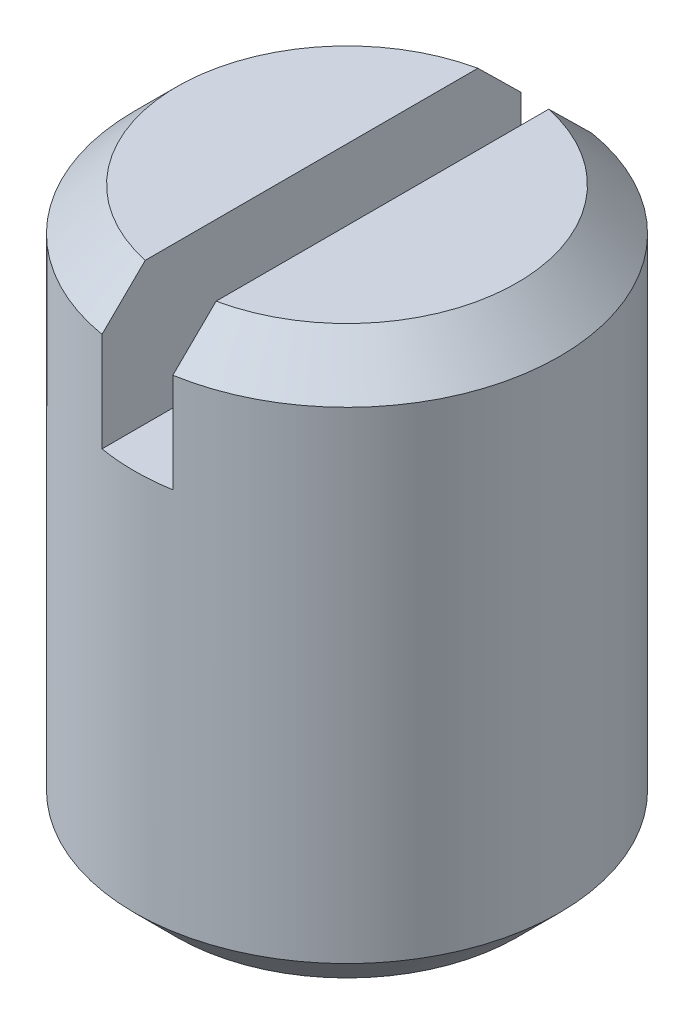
ISO-10303-21;
HEADER;
FILE_DESCRIPTION(('STEP AP214'),'2;1');
FILE_NAME('part.step','',(''),(''),'','','');
FILE_SCHEMA(('AUTOMOTIVE_DESIGN { 1 0 10303 214 1 1 1 1 }'));
ENDSEC;
DATA;
#1=APPLICATION_CONTEXT('core data for automotive mechanical design processes');
#2=APPLICATION_PROTOCOL_DEFINITION('international standard','automotive_design',2000,#1);
#3=PRODUCT_CONTEXT('',#1,'mechanical');
#4=PRODUCT('Part','Part','',(#3));
#5=PRODUCT_RELATED_PRODUCT_CATEGORY('part','',(#4));
#6=PRODUCT_DEFINITION_FORMATION('','',#4);
#7=PRODUCT_DEFINITION_CONTEXT('part definition',#1,'design');
#8=PRODUCT_DEFINITION('design','',#6,#7);
#9=PRODUCT_DEFINITION_SHAPE('','',#8);
#10=(LENGTH_UNIT() NAMED_UNIT(*) SI_UNIT(.MILLI.,.METRE.));
#11=(NAMED_UNIT(*) PLANE_ANGLE_UNIT() SI_UNIT($,.RADIAN.));
#12=(NAMED_UNIT(*) SI_UNIT($,.STERADIAN.) SOLID_ANGLE_UNIT());
#13=UNCERTAINTY_MEASURE_WITH_UNIT(LENGTH_MEASURE(1.E-05),#10,'distance_accuracy_value','');
#14=(GEOMETRIC_REPRESENTATION_CONTEXT(3) GLOBAL_UNCERTAINTY_ASSIGNED_CONTEXT((#13)) GLOBAL_UNIT_ASSIGNED_CONTEXT((#10,
#11,#12)) REPRESENTATION_CONTEXT('',''));
#15=CARTESIAN_POINT('',(0.,0.,0.));
#16=DIRECTION('',(0.,0.,1.));
#17=DIRECTION('',(1.,0.,0.));
#18=AXIS2_PLACEMENT_3D('',#15,#16,#17);
#19=CARTESIAN_POINT('',(0.,0.,0.));
#20=DIRECTION('',(0.,-1.,0.));
#21=DIRECTION('',(0.,0.,-1.));
#22=AXIS2_PLACEMENT_3D('',#19,#20,#21);
#23=PLANE('',#22);
#24=CARTESIAN_POINT('',(0.,0.,0.));
#25=DIRECTION('',(0.,-1.,0.));
#26=DIRECTION('',(0.,0.,-1.));
#27=AXIS2_PLACEMENT_3D('',#24,#25,#26);
#28=CIRCLE('',#27,2.4);
#29=CARTESIAN_POINT('',(0.500000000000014,0.,2.3473389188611));
#30=VERTEX_POINT('',#29);
#31=CARTESIAN_POINT('',(0.500000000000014,0.,-2.3473389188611));
#32=VERTEX_POINT('',#31);
#33=EDGE_CURVE('E94',#30,#32,#28,.F.);
#34=ORIENTED_EDGE('',*,*,#33,.T.);
#35=DIRECTION('',(0.,0.,-1.));
#36=VECTOR('',#35,1.);
#37=CARTESIAN_POINT('',(0.500000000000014,0.,3.));
#38=LINE('',#37,#36);
#39=EDGE_CURVE('E83',#30,#32,#38,.T.);
#40=ORIENTED_EDGE('',*,*,#39,.F.);
#41=EDGE_LOOP('',(#34,#40));
#42=FACE_BOUND('',#41,.T.);
#43=ADVANCED_FACE('F28',(#42),#23,.F.);
#44=CARTESIAN_POINT('',(0.,0.,0.));
#45=DIRECTION('',(0.,-1.,0.));
#46=DIRECTION('',(0.,0.,-1.));
#47=AXIS2_PLACEMENT_3D('',#44,#45,#46);
#48=CONICAL_SURFACE('',#47,2.4,0.785398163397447);
#49=CARTESIAN_POINT('',(0.500000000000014,1.81909847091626,-0.295713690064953));
#50=CARTESIAN_POINT('',(0.500000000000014,1.80683306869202,-0.319750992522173));
#51=CARTESIAN_POINT('',(0.500000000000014,1.79374756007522,-0.343341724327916));
#52=CARTESIAN_POINT('',(0.500000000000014,1.76632309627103,-0.389750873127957));
#53=CARTESIAN_POINT('',(0.500000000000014,1.7519855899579,-0.412570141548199));
#54=CARTESIAN_POINT('',(0.500000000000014,1.72245766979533,-0.457545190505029));
#55=CARTESIAN_POINT('',(0.500000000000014,1.70726988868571,-0.479702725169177));
#56=CARTESIAN_POINT('',(0.500000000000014,1.67621678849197,-0.523546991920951));
#57=CARTESIAN_POINT('',(0.500000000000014,1.66035124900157,-0.545233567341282));
#58=CARTESIAN_POINT('',(0.500000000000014,1.61210780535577,-0.609576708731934));
#59=CARTESIAN_POINT('',(0.500000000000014,1.57897970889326,-0.651668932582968));
#60=CARTESIAN_POINT('',(0.500000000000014,1.51147311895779,-0.734892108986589));
#61=CARTESIAN_POINT('',(0.500000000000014,1.47709345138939,-0.776022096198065));
#62=CARTESIAN_POINT('',(0.500000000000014,1.40844074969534,-0.856515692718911));
#63=CARTESIAN_POINT('',(0.500000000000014,1.37418875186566,-0.895897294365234));
#64=CARTESIAN_POINT('',(0.500000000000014,1.30514716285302,-0.974187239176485));
#65=CARTESIAN_POINT('',(0.500000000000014,1.27035755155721,-1.01309556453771));
#66=CARTESIAN_POINT('',(0.500000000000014,1.1654069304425,-1.12930934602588));
#67=CARTESIAN_POINT('',(0.500000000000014,1.0946714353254,-1.20609519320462));
#68=CARTESIAN_POINT('',(0.500000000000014,0.952342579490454,-1.35884765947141));
#69=CARTESIAN_POINT('',(0.500000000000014,0.880749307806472,-1.43481436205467));
#70=CARTESIAN_POINT('',(0.500000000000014,0.737014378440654,-1.58621658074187));
#71=CARTESIAN_POINT('',(0.500000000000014,0.664872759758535,-1.66165213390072));
#72=CARTESIAN_POINT('',(0.500000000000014,0.447151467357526,-1.88822590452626));
#73=CARTESIAN_POINT('',(0.500000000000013,0.30102405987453,-2.03883696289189));
#74=CARTESIAN_POINT('',(0.500000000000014,0.00805243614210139,-2.33933547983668));
#75=CARTESIAN_POINT('',(0.500000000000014,-0.138791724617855,-2.48922299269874));
#76=CARTESIAN_POINT('',(0.500000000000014,-0.470302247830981,-2.82663559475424));
#77=CARTESIAN_POINT('',(0.500000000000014,-0.655091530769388,-3.01403988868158));
#78=CARTESIAN_POINT('',(0.500000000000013,-1.02505279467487,-3.3884807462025));
#79=CARTESIAN_POINT('',(0.500000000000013,-1.21022478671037,-3.57551729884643));
#80=CARTESIAN_POINT('',(0.500000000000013,-1.57944526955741,-3.94798531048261));
#81=CARTESIAN_POINT('',(0.500000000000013,-1.76349203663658,-4.13341847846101));
#82=CARTESIAN_POINT('',(0.500000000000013,-2.13173997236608,-4.50411934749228));
#83=CARTESIAN_POINT('',(0.500000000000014,-2.31594113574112,-4.68938705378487));
#84=CARTESIAN_POINT('',(0.500000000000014,-2.50018656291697,-4.8746105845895));
#85=B_SPLINE_CURVE_WITH_KNOTS('',3,(#49,#50,#51,#52,#53,#54,#55,#56,#57,#58,#59,#60,#61,#62,#63,
#64,#65,#66,#67,#68,#69,#70,#71,#72,#73,#74,#75,#76,#77,#78,#79,#80,#81,#82,#83,#84),
.UNSPECIFIED.,.F.,.F.,(4,2,2,2,2,2,2,2,2,2,2,2,2,2,2,2,2,4),(0.,0.0809053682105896,
0.161718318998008,0.24229357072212,0.322895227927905,0.483547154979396,0.644353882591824,
0.800925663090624,0.95750331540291,1.27069203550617,1.58384852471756,1.8969829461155,
2.52652617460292,3.15602141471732,3.94558150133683,4.73516475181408,5.51895544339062,
6.30272036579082),.UNSPECIFIED.);
#86=CARTESIAN_POINT('',(0.500000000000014,-0.600000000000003,-2.95803989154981));
#87=VERTEX_POINT('',#86);
#88=EDGE_CURVE('E51',#32,#87,#85,.T.);
#89=ORIENTED_EDGE('',*,*,#88,.F.);
#90=ORIENTED_EDGE('',*,*,#33,.F.);
#91=CARTESIAN_POINT('',(0.500000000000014,-2.50018656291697,4.8746105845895));
#92=CARTESIAN_POINT('',(0.500000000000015,-2.31518080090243,4.68862360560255));
#93=CARTESIAN_POINT('',(0.500000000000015,-2.13022040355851,4.50259141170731));
#94=CARTESIAN_POINT('',(0.500000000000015,-1.76050201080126,4.13040668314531));
#95=CARTESIAN_POINT('',(0.500000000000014,-1.57574398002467,3.94425418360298));
#96=CARTESIAN_POINT('',(0.500000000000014,-1.20657166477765,3.57182927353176));
#97=CARTESIAN_POINT('',(0.500000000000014,-1.02215724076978,3.38555700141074));
#98=CARTESIAN_POINT('',(0.500000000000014,-0.745803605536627,3.10584681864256));
#99=CARTESIAN_POINT('',(0.500000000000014,-0.653721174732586,3.01255042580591));
#100=CARTESIAN_POINT('',(0.500000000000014,-0.469680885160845,2.82583051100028));
#101=CARTESIAN_POINT('',(0.500000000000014,-0.377723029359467,2.73240698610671));
#102=CARTESIAN_POINT('',(0.500000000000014,-0.193863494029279,2.54527638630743));
#103=CARTESIAN_POINT('',(0.500000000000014,-0.101962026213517,2.45156910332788));
#104=CARTESIAN_POINT('',(0.500000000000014,0.0815957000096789,2.26392997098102));
#105=CARTESIAN_POINT('',(0.500000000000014,0.173251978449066,2.16999814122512));
#106=CARTESIAN_POINT('',(0.500000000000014,0.356159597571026,1.98185993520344));
#107=CARTESIAN_POINT('',(0.500000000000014,0.44741116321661,1.88765377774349));
#108=CARTESIAN_POINT('',(0.500000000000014,0.629419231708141,1.69870815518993));
#109=CARTESIAN_POINT('',(0.500000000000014,0.720175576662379,1.60396853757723));
#110=CARTESIAN_POINT('',(0.500000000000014,0.855759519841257,1.46112952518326));
#111=CARTESIAN_POINT('',(0.500000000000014,0.900913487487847,1.41334010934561));
#112=CARTESIAN_POINT('',(0.500000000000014,0.990922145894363,1.31748760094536));
#113=CARTESIAN_POINT('',(0.500000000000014,1.03577686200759,1.26942453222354));
#114=CARTESIAN_POINT('',(0.500000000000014,1.12503774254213,1.17297174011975));
#115=CARTESIAN_POINT('',(0.500000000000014,1.1694443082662,1.12458238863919));
#116=CARTESIAN_POINT('',(0.500000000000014,1.2576979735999,1.02726652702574));
#117=CARTESIAN_POINT('',(0.500000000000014,1.30154489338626,0.978339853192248));
#118=CARTESIAN_POINT('',(0.500000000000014,1.38853350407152,0.879553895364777));
#119=CARTESIAN_POINT('',(0.500000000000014,1.43167214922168,0.829691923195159));
#120=CARTESIAN_POINT('',(0.500000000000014,1.51655495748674,0.728853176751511));
#121=CARTESIAN_POINT('',(0.500000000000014,1.55830030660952,0.677877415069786));
#122=CARTESIAN_POINT('',(0.500000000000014,1.61921521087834,0.599904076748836));
#123=CARTESIAN_POINT('',(0.500000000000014,1.63927572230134,0.573605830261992));
#124=CARTESIAN_POINT('',(0.500000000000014,1.67854779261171,0.520399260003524));
#125=CARTESIAN_POINT('',(0.500000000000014,1.69775972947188,0.493491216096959));
#126=CARTESIAN_POINT('',(0.500000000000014,1.73507848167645,0.438780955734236));
#127=CARTESIAN_POINT('',(0.500000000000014,1.75318168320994,0.4109762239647));
#128=CARTESIAN_POINT('',(0.500000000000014,1.78762712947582,0.354244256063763));
#129=CARTESIAN_POINT('',(0.500000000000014,1.80396653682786,0.325315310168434));
#130=CARTESIAN_POINT('',(0.500000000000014,1.81909847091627,0.295713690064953));
#131=B_SPLINE_CURVE_WITH_KNOTS('',3,(#91,#92,#93,#94,#95,#96,#97,#98,#99,#100,#101,#102,#103,
#104,#105,#106,#107,#108,#109,#110,#111,#112,#113,#114,#115,#116,#117,#118,#119,#120,#121,#122,
#123,#124,#125,#126,#127,#128,#129,#130),.UNSPECIFIED.,.F.,.F.,(4,2,2,2,2,2,2,2,2,2,2,2,2,2,2,2,
2,2,2,4),(0.,0.7869972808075,1.57382280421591,2.36017750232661,2.75343371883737,
3.14669914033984,3.54045312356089,3.93417388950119,4.3276380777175,4.72122113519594,
4.91846220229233,5.11568634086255,5.31271457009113,5.50980458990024,5.70759226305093,
5.90520704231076,6.00442239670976,6.10359310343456,6.20307150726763,6.30270762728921),.UNSPECIFIED.);
#132=CARTESIAN_POINT('',(0.500000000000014,-0.600000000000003,2.95803989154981));
#133=VERTEX_POINT('',#132);
#134=EDGE_CURVE('E79',#133,#30,#131,.T.);
#135=ORIENTED_EDGE('',*,*,#134,.F.);
#136=CARTESIAN_POINT('',(0.,-0.600000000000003,0.));
#137=DIRECTION('',(0.,-1.,0.));
#138=DIRECTION('',(0.,0.,-1.));
#139=AXIS2_PLACEMENT_3D('',#136,#137,#138);
#140=CIRCLE('',#139,3.);
#141=EDGE_CURVE('E109',#87,#133,#140,.T.);
#142=ORIENTED_EDGE('',*,*,#141,.F.);
#143=EDGE_LOOP('',(#89,#90,#135,#142));
#144=FACE_BOUND('',#143,.T.);
#145=ADVANCED_FACE('F96',(#144),#48,.T.);
#146=CARTESIAN_POINT('',(0.,-8.,0.));
#147=DIRECTION('',(0.,1.,0.));
#148=DIRECTION('',(0.,0.,1.));
#149=AXIS2_PLACEMENT_3D('',#146,#147,#148);
#150=PLANE('',#149);
#151=CARTESIAN_POINT('',(0.,-8.,0.));
#152=DIRECTION('',(0.,1.,0.));
#153=DIRECTION('',(0.,0.,1.));
#154=AXIS2_PLACEMENT_3D('',#151,#152,#153);
#155=CIRCLE('',#154,2.4);
#156=CARTESIAN_POINT('',(0.,-8.,2.4));
#157=VERTEX_POINT('',#156);
#158=EDGE_CURVE('E98',#157,#157,#155,.F.);
#159=ORIENTED_EDGE('',*,*,#158,.T.);
#160=EDGE_LOOP('',(#159));
#161=FACE_BOUND('',#160,.T.);
#162=ADVANCED_FACE('F30',(#161),#150,.F.);
#163=CARTESIAN_POINT('',(0.,0.,0.));
#164=DIRECTION('',(0.,1.,0.));
#165=DIRECTION('',(0.,0.,1.));
#166=AXIS2_PLACEMENT_3D('',#163,#164,#165);
#167=CYLINDRICAL_SURFACE('',#166,3.);
#168=CARTESIAN_POINT('',(0.,-2.,0.));
#169=DIRECTION('',(0.,1.,0.));
#170=DIRECTION('',(0.,0.,1.));
#171=AXIS2_PLACEMENT_3D('',#168,#169,#170);
#172=CIRCLE('',#171,3.);
#173=CARTESIAN_POINT('',(0.500000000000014,-2.,-2.95803989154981));
#174=VERTEX_POINT('',#173);
#175=CARTESIAN_POINT('',(-0.499999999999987,-2.,-2.95803989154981));
#176=VERTEX_POINT('',#175);
#177=EDGE_CURVE('E11',#174,#176,#172,.T.);
#178=ORIENTED_EDGE('',*,*,#177,.F.);
#179=DIRECTION('',(0.,1.,0.));
#180=VECTOR('',#179,1.);
#181=CARTESIAN_POINT('',(0.500000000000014,0.,-2.95803989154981));
#182=LINE('',#181,#180);
#183=EDGE_CURVE('E148',#174,#87,#182,.T.);
#184=ORIENTED_EDGE('',*,*,#183,.T.);
#185=ORIENTED_EDGE('',*,*,#141,.T.);
#186=DIRECTION('',(0.,1.,0.));
#187=VECTOR('',#186,1.);
#188=CARTESIAN_POINT('',(0.500000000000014,0.,2.95803989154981));
#189=LINE('',#188,#187);
#190=CARTESIAN_POINT('',(0.500000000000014,-2.,2.95803989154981));
#191=VERTEX_POINT('',#190);
#192=EDGE_CURVE('E85',#133,#191,#189,.F.);
#193=ORIENTED_EDGE('',*,*,#192,.T.);
#194=CARTESIAN_POINT('',(-0.499999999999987,-2.,2.95803989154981));
#195=VERTEX_POINT('',#194);
#196=EDGE_CURVE('E32',#195,#191,#172,.T.);
#197=ORIENTED_EDGE('',*,*,#196,.F.);
#198=DIRECTION('',(0.,1.,0.));
#199=VECTOR('',#198,1.);
#200=CARTESIAN_POINT('',(-0.499999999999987,0.,2.95803989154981));
#201=LINE('',#200,#199);
#202=CARTESIAN_POINT('',(-0.499999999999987,-0.600000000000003,2.95803989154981));
#203=VERTEX_POINT('',#202);
#204=EDGE_CURVE('E156',#195,#203,#201,.T.);
#205=ORIENTED_EDGE('',*,*,#204,.T.);
#206=CARTESIAN_POINT('',(-0.499999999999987,-0.600000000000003,-2.95803989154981));
#207=VERTEX_POINT('',#206);
#208=EDGE_CURVE('E101',#203,#207,#140,.T.);
#209=ORIENTED_EDGE('',*,*,#208,.T.);
#210=DIRECTION('',(0.,1.,0.));
#211=VECTOR('',#210,1.);
#212=CARTESIAN_POINT('',(-0.499999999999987,0.,-2.95803989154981));
#213=LINE('',#212,#211);
#214=EDGE_CURVE('E152',#207,#176,#213,.F.);
#215=ORIENTED_EDGE('',*,*,#214,.T.);
#216=EDGE_LOOP('',(#178,#184,#185,#193,#197,#205,#209,#215));
#217=FACE_BOUND('',#216,.T.);
#218=CARTESIAN_POINT('',(0.,-7.4,0.));
#219=DIRECTION('',(0.,1.,0.));
#220=DIRECTION('',(0.,0.,1.));
#221=AXIS2_PLACEMENT_3D('',#218,#219,#220);
#222=CIRCLE('',#221,3.);
#223=CARTESIAN_POINT('',(0.,-7.4,3.));
#224=VERTEX_POINT('',#223);
#225=EDGE_CURVE('E103',#224,#224,#222,.T.);
#226=ORIENTED_EDGE('',*,*,#225,.T.);
#227=EDGE_LOOP('',(#226));
#228=FACE_BOUND('',#227,.T.);
#229=ADVANCED_FACE('F150',(#217,#228),#167,.T.);
#230=CARTESIAN_POINT('',(-0.499999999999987,0.,-2.3473389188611));
#231=VERTEX_POINT('',#230);
#232=CARTESIAN_POINT('',(-0.499999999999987,0.,2.3473389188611));
#233=VERTEX_POINT('',#232);
#234=EDGE_CURVE('E97',#231,#233,#28,.F.);
#235=ORIENTED_EDGE('',*,*,#234,.T.);
#236=DIRECTION('',(0.,0.,1.));
#237=VECTOR('',#236,1.);
#238=CARTESIAN_POINT('',(-0.499999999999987,0.,3.));
#239=LINE('',#238,#237);
#240=EDGE_CURVE('E43',#231,#233,#239,.T.);
#241=ORIENTED_EDGE('',*,*,#240,.F.);
#242=EDGE_LOOP('',(#235,#241));
#243=FACE_BOUND('',#242,.T.);
#244=ADVANCED_FACE('F164',(#243),#23,.F.);
#245=CARTESIAN_POINT('',(0.,-7.4,0.));
#246=DIRECTION('',(0.,1.,0.));
#247=DIRECTION('',(0.,0.,1.));
#248=AXIS2_PLACEMENT_3D('',#245,#246,#247);
#249=CONICAL_SURFACE('',#248,3.,0.78539816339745);
#250=ORIENTED_EDGE('',*,*,#158,.F.);
#251=EDGE_LOOP('',(#250));
#252=FACE_BOUND('',#251,.T.);
#253=ORIENTED_EDGE('',*,*,#225,.F.);
#254=EDGE_LOOP('',(#253));
#255=FACE_BOUND('',#254,.T.);
#256=ADVANCED_FACE('F162',(#252,#255),#249,.T.);
#257=CARTESIAN_POINT('',(-0.499999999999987,-2.50018656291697,-4.8746105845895));
#258=CARTESIAN_POINT('',(-0.499999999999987,-2.31518080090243,-4.68862360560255));
#259=CARTESIAN_POINT('',(-0.499999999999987,-2.13022040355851,-4.50259141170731));
#260=CARTESIAN_POINT('',(-0.499999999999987,-1.76050201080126,-4.13040668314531));
#261=CARTESIAN_POINT('',(-0.499999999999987,-1.57574398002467,-3.94425418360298));
#262=CARTESIAN_POINT('',(-0.499999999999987,-1.20657166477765,-3.57182927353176));
#263=CARTESIAN_POINT('',(-0.499999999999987,-1.02215724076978,-3.38555700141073));
#264=CARTESIAN_POINT('',(-0.499999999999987,-0.745803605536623,-3.10584681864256));
#265=CARTESIAN_POINT('',(-0.499999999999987,-0.653721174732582,-3.0125504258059));
#266=CARTESIAN_POINT('',(-0.499999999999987,-0.469680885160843,-2.82583051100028));
#267=CARTESIAN_POINT('',(-0.499999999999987,-0.377723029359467,-2.7324069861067));
#268=CARTESIAN_POINT('',(-0.499999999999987,-0.193863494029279,-2.54527638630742));
#269=CARTESIAN_POINT('',(-0.499999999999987,-0.101962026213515,-2.45156910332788));
#270=CARTESIAN_POINT('',(-0.499999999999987,0.0815957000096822,-2.26392997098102));
#271=CARTESIAN_POINT('',(-0.499999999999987,0.173251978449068,-2.16999814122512));
#272=CARTESIAN_POINT('',(-0.499999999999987,0.356159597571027,-1.98185993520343));
#273=CARTESIAN_POINT('',(-0.499999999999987,0.447411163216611,-1.88765377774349));
#274=CARTESIAN_POINT('',(-0.499999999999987,0.629419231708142,-1.69870815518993));
#275=CARTESIAN_POINT('',(-0.499999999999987,0.72017557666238,-1.60396853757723));
#276=CARTESIAN_POINT('',(-0.499999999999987,0.855759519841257,-1.46112952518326));
#277=CARTESIAN_POINT('',(-0.499999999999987,0.900913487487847,-1.41334010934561));
#278=CARTESIAN_POINT('',(-0.499999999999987,0.990922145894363,-1.31748760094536));
#279=CARTESIAN_POINT('',(-0.499999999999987,1.03577686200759,-1.26942453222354));
#280=CARTESIAN_POINT('',(-0.499999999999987,1.12503774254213,-1.17297174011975));
#281=CARTESIAN_POINT('',(-0.499999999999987,1.1694443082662,-1.12458238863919));
#282=CARTESIAN_POINT('',(-0.499999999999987,1.2576979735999,-1.02726652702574));
#283=CARTESIAN_POINT('',(-0.499999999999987,1.30154489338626,-0.978339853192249));
#284=CARTESIAN_POINT('',(-0.499999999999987,1.38853350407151,-0.879553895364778));
#285=CARTESIAN_POINT('',(-0.499999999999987,1.43167214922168,-0.829691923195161));
#286=CARTESIAN_POINT('',(-0.499999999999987,1.51655495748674,-0.728853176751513));
#287=CARTESIAN_POINT('',(-0.499999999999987,1.55830030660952,-0.677877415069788));
#288=CARTESIAN_POINT('',(-0.499999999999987,1.61921521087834,-0.599904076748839));
#289=CARTESIAN_POINT('',(-0.499999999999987,1.63927572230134,-0.573605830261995));
#290=CARTESIAN_POINT('',(-0.499999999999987,1.67854779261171,-0.520399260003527));
#291=CARTESIAN_POINT('',(-0.499999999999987,1.69775972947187,-0.493491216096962));
#292=CARTESIAN_POINT('',(-0.499999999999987,1.73507848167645,-0.43878095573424));
#293=CARTESIAN_POINT('',(-0.499999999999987,1.75318168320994,-0.410976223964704));
#294=CARTESIAN_POINT('',(-0.499999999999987,1.78762712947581,-0.354244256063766));
#295=CARTESIAN_POINT('',(-0.499999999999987,1.80396653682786,-0.325315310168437));
#296=CARTESIAN_POINT('',(-0.499999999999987,1.81909847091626,-0.295713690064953));
#297=B_SPLINE_CURVE_WITH_KNOTS('',3,(#257,#258,#259,#260,#261,#262,#263,#264,#265,#266,#267,
#268,#269,#270,#271,#272,#273,#274,#275,#276,#277,#278,#279,#280,#281,#282,#283,#284,#285,#286,
#287,#288,#289,#290,#291,#292,#293,#294,#295,#296),.UNSPECIFIED.,.F.,.F.,(4,2,2,2,2,2,2,2,2,2,2,
2,2,2,2,2,2,2,2,4),(0.,0.786997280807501,1.57382280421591,2.36017750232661,2.75343371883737,
3.14669914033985,3.54045312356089,3.93417388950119,4.3276380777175,4.72122113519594,
4.91846220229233,5.11568634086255,5.31271457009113,5.50980458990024,5.70759226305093,
5.90520704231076,6.00442239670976,6.10359310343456,6.20307150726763,6.3027076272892),.UNSPECIFIED.);
#298=EDGE_CURVE('E90',#207,#231,#297,.T.);
#299=ORIENTED_EDGE('',*,*,#298,.F.);
#300=ORIENTED_EDGE('',*,*,#208,.F.);
#301=CARTESIAN_POINT('',(-0.499999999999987,1.81909847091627,0.295713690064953));
#302=CARTESIAN_POINT('',(-0.499999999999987,1.80683306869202,0.319750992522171));
#303=CARTESIAN_POINT('',(-0.499999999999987,1.79374756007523,0.343341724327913));
#304=CARTESIAN_POINT('',(-0.499999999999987,1.76632309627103,0.389750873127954));
#305=CARTESIAN_POINT('',(-0.499999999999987,1.7519855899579,0.412570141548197));
#306=CARTESIAN_POINT('',(-0.499999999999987,1.72245766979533,0.457545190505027));
#307=CARTESIAN_POINT('',(-0.499999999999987,1.70726988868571,0.479702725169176));
#308=CARTESIAN_POINT('',(-0.499999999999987,1.67621678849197,0.523546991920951));
#309=CARTESIAN_POINT('',(-0.499999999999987,1.66035124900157,0.545233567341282));
#310=CARTESIAN_POINT('',(-0.499999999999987,1.61210780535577,0.609576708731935));
#311=CARTESIAN_POINT('',(-0.499999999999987,1.57897970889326,0.651668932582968));
#312=CARTESIAN_POINT('',(-0.499999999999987,1.51147311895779,0.734892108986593));
#313=CARTESIAN_POINT('',(-0.499999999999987,1.47709345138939,0.776022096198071));
#314=CARTESIAN_POINT('',(-0.499999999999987,1.40844074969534,0.856515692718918));
#315=CARTESIAN_POINT('',(-0.499999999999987,1.37418875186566,0.895897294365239));
#316=CARTESIAN_POINT('',(-0.499999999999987,1.30514716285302,0.974187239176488));
#317=CARTESIAN_POINT('',(-0.499999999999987,1.2703575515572,1.01309556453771));
#318=CARTESIAN_POINT('',(-0.499999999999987,1.1654069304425,1.12930934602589));
#319=CARTESIAN_POINT('',(-0.499999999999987,1.09467143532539,1.20609519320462));
#320=CARTESIAN_POINT('',(-0.499999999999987,0.952342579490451,1.35884765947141));
#321=CARTESIAN_POINT('',(-0.499999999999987,0.880749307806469,1.43481436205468));
#322=CARTESIAN_POINT('',(-0.499999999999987,0.737014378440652,1.58621658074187));
#323=CARTESIAN_POINT('',(-0.499999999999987,0.664872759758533,1.66165213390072));
#324=CARTESIAN_POINT('',(-0.499999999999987,0.447151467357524,1.88822590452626));
#325=CARTESIAN_POINT('',(-0.499999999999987,0.301024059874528,2.03883696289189));
#326=CARTESIAN_POINT('',(-0.499999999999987,0.00805243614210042,2.33933547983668));
#327=CARTESIAN_POINT('',(-0.499999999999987,-0.138791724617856,2.48922299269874));
#328=CARTESIAN_POINT('',(-0.499999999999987,-0.470302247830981,2.82663559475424));
#329=CARTESIAN_POINT('',(-0.499999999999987,-0.655091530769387,3.01403988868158));
#330=CARTESIAN_POINT('',(-0.499999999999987,-1.02505279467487,3.3884807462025));
#331=CARTESIAN_POINT('',(-0.499999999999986,-1.21022478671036,3.57551729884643));
#332=CARTESIAN_POINT('',(-0.499999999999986,-1.57944526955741,3.94798531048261));
#333=CARTESIAN_POINT('',(-0.499999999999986,-1.76349203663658,4.13341847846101));
#334=CARTESIAN_POINT('',(-0.499999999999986,-2.13173997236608,4.50411934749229));
#335=CARTESIAN_POINT('',(-0.499999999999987,-2.31594113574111,4.68938705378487));
#336=CARTESIAN_POINT('',(-0.499999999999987,-2.50018656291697,4.8746105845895));
#337=B_SPLINE_CURVE_WITH_KNOTS('',3,(#301,#302,#303,#304,#305,#306,#307,#308,#309,#310,#311,
#312,#313,#314,#315,#316,#317,#318,#319,#320,#321,#322,#323,#324,#325,#326,#327,#328,#329,#330,
#331,#332,#333,#334,#335,#336),.UNSPECIFIED.,.F.,.F.,(4,2,2,2,2,2,2,2,2,2,2,2,2,2,2,2,2,4),(0.,
0.0809053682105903,0.16171831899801,0.242293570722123,0.322895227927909,0.483547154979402,
0.644353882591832,0.800925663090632,0.957503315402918,1.27069203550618,1.58384852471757,
1.89698294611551,2.52652617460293,3.15602141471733,3.94558150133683,4.73516475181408,
5.51895544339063,6.30272036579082),.UNSPECIFIED.);
#338=EDGE_CURVE('E110',#233,#203,#337,.T.);
#339=ORIENTED_EDGE('',*,*,#338,.F.);
#340=ORIENTED_EDGE('',*,*,#234,.F.);
#341=EDGE_LOOP('',(#299,#300,#339,#340));
#342=FACE_BOUND('',#341,.T.);
#343=ADVANCED_FACE('F120',(#342),#48,.T.);
#344=CARTESIAN_POINT('',(0.500000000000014,-2.,-3.));
#345=DIRECTION('',(0.,1.,0.));
#346=DIRECTION('',(0.,0.,1.));
#347=AXIS2_PLACEMENT_3D('',#344,#345,#346);
#348=PLANE('',#347);
#349=DIRECTION('',(0.,0.,-1.));
#350=VECTOR('',#349,1.);
#351=CARTESIAN_POINT('',(0.500000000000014,-2.,3.));
#352=LINE('',#351,#350);
#353=EDGE_CURVE('E143',#191,#174,#352,.T.);
#354=ORIENTED_EDGE('',*,*,#353,.T.);
#355=ORIENTED_EDGE('',*,*,#177,.T.);
#356=DIRECTION('',(0.,0.,1.));
#357=VECTOR('',#356,1.);
#358=CARTESIAN_POINT('',(-0.499999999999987,-2.,3.));
#359=LINE('',#358,#357);
#360=EDGE_CURVE('E145',#176,#195,#359,.T.);
#361=ORIENTED_EDGE('',*,*,#360,.T.);
#362=ORIENTED_EDGE('',*,*,#196,.T.);
#363=EDGE_LOOP('',(#354,#355,#361,#362));
#364=FACE_BOUND('',#363,.T.);
#365=ADVANCED_FACE('F128',(#364),#348,.T.);
#366=CARTESIAN_POINT('',(0.500000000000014,-2.,3.));
#367=DIRECTION('',(1.,0.,0.));
#368=DIRECTION('',(0.,0.,-1.));
#369=AXIS2_PLACEMENT_3D('',#366,#367,#368);
#370=PLANE('',#369);
#371=ORIENTED_EDGE('',*,*,#353,.F.);
#372=ORIENTED_EDGE('',*,*,#192,.F.);
#373=ORIENTED_EDGE('',*,*,#134,.T.);
#374=ORIENTED_EDGE('',*,*,#39,.T.);
#375=ORIENTED_EDGE('',*,*,#88,.T.);
#376=ORIENTED_EDGE('',*,*,#183,.F.);
#377=EDGE_LOOP('',(#371,#372,#373,#374,#375,#376));
#378=FACE_BOUND('',#377,.T.);
#379=ADVANCED_FACE('F82',(#378),#370,.F.);
#380=CARTESIAN_POINT('',(-0.499999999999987,-2.,3.));
#381=DIRECTION('',(-1.,0.,0.));
#382=DIRECTION('',(0.,0.,1.));
#383=AXIS2_PLACEMENT_3D('',#380,#381,#382);
#384=PLANE('',#383);
#385=ORIENTED_EDGE('',*,*,#298,.T.);
#386=ORIENTED_EDGE('',*,*,#240,.T.);
#387=ORIENTED_EDGE('',*,*,#338,.T.);
#388=ORIENTED_EDGE('',*,*,#204,.F.);
#389=ORIENTED_EDGE('',*,*,#360,.F.);
#390=ORIENTED_EDGE('',*,*,#214,.F.);
#391=EDGE_LOOP('',(#385,#386,#387,#388,#389,#390));
#392=FACE_BOUND('',#391,.T.);
#393=ADVANCED_FACE('F124',(#392),#384,.F.);
#394=CLOSED_SHELL('',(#43,#145,#162,#229,#244,#256,#343,#365,#379,#393));
#395=MANIFOLD_SOLID_BREP('B2',#394);
#396=ADVANCED_BREP_SHAPE_REPRESENTATION('',(#18,#395),#14);
#397=SHAPE_DEFINITION_REPRESENTATION(#9,#396);
ENDSEC;
END-ISO-10303-21;
